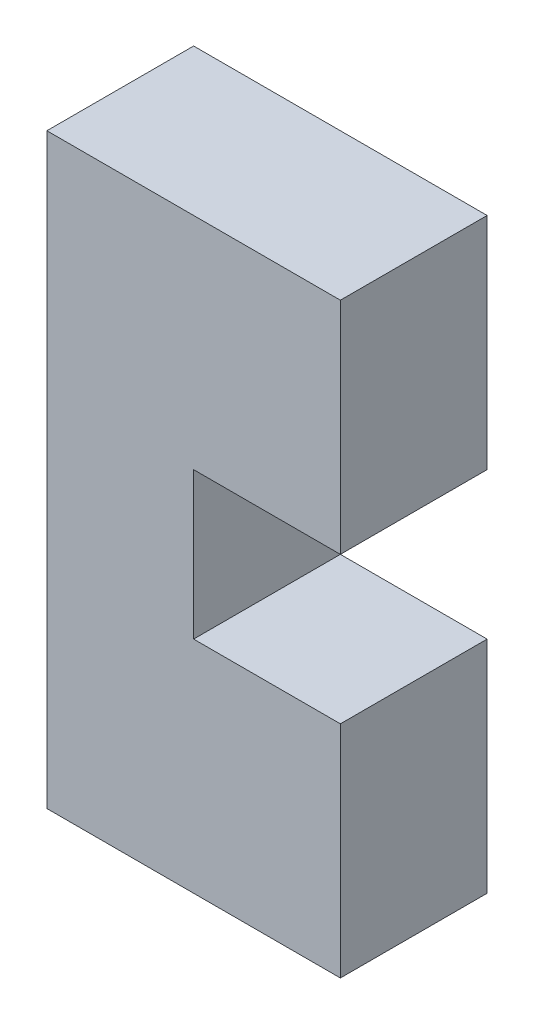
ISO-10303-21;
HEADER;
FILE_DESCRIPTION(('STEP AP214'),'2;1');
FILE_NAME('part.step','',(''),(''),'','','');
FILE_SCHEMA(('AUTOMOTIVE_DESIGN { 1 0 10303 214 1 1 1 1 }'));
ENDSEC;
DATA;
#1=APPLICATION_CONTEXT('core data for automotive mechanical design processes');
#2=APPLICATION_PROTOCOL_DEFINITION('international standard','automotive_design',2000,#1);
#3=PRODUCT_CONTEXT('',#1,'mechanical');
#4=PRODUCT('Part','Part','',(#3));
#5=PRODUCT_RELATED_PRODUCT_CATEGORY('part','',(#4));
#6=PRODUCT_DEFINITION_FORMATION('','',#4);
#7=PRODUCT_DEFINITION_CONTEXT('part definition',#1,'design');
#8=PRODUCT_DEFINITION('design','',#6,#7);
#9=PRODUCT_DEFINITION_SHAPE('','',#8);
#10=(LENGTH_UNIT() NAMED_UNIT(*) SI_UNIT(.MILLI.,.METRE.));
#11=(NAMED_UNIT(*) PLANE_ANGLE_UNIT() SI_UNIT($,.RADIAN.));
#12=(NAMED_UNIT(*) SI_UNIT($,.STERADIAN.) SOLID_ANGLE_UNIT());
#13=UNCERTAINTY_MEASURE_WITH_UNIT(LENGTH_MEASURE(1.E-05),#10,'distance_accuracy_value','');
#14=(GEOMETRIC_REPRESENTATION_CONTEXT(3) GLOBAL_UNCERTAINTY_ASSIGNED_CONTEXT((#13)) GLOBAL_UNIT_ASSIGNED_CONTEXT((#10,
#11,#12)) REPRESENTATION_CONTEXT('',''));
#15=CARTESIAN_POINT('',(0.,0.,0.));
#16=DIRECTION('',(0.,0.,1.));
#17=DIRECTION('',(1.,0.,0.));
#18=AXIS2_PLACEMENT_3D('',#15,#16,#17);
#19=CARTESIAN_POINT('',(-5.,-10.,5.));
#20=DIRECTION('',(1.,0.,0.));
#21=DIRECTION('',(0.,0.,-1.));
#22=AXIS2_PLACEMENT_3D('',#19,#20,#21);
#23=PLANE('',#22);
#24=DIRECTION('',(0.,-1.,0.));
#25=VECTOR('',#24,1.);
#26=CARTESIAN_POINT('',(-5.,-10.,0.));
#27=LINE('',#26,#25);
#28=CARTESIAN_POINT('',(-5.,10.,0.));
#29=VERTEX_POINT('',#28);
#30=CARTESIAN_POINT('',(-5.,-10.,0.));
#31=VERTEX_POINT('',#30);
#32=EDGE_CURVE('E129',#29,#31,#27,.T.);
#33=ORIENTED_EDGE('',*,*,#32,.T.);
#34=DIRECTION('',(0.,0.,-1.));
#35=VECTOR('',#34,1.);
#36=CARTESIAN_POINT('',(-5.,-10.,5.));
#37=LINE('',#36,#35);
#38=CARTESIAN_POINT('',(-5.,-10.,5.));
#39=VERTEX_POINT('',#38);
#40=EDGE_CURVE('E11',#39,#31,#37,.T.);
#41=ORIENTED_EDGE('',*,*,#40,.F.);
#42=DIRECTION('',(0.,-1.,0.));
#43=VECTOR('',#42,1.);
#44=CARTESIAN_POINT('',(-5.,-10.,5.));
#45=LINE('',#44,#43);
#46=CARTESIAN_POINT('',(-5.,10.,5.));
#47=VERTEX_POINT('',#46);
#48=EDGE_CURVE('E143',#47,#39,#45,.T.);
#49=ORIENTED_EDGE('',*,*,#48,.F.);
#50=DIRECTION('',(0.,0.,-1.));
#51=VECTOR('',#50,1.);
#52=CARTESIAN_POINT('',(-5.,10.,5.));
#53=LINE('',#52,#51);
#54=EDGE_CURVE('E125',#47,#29,#53,.T.);
#55=ORIENTED_EDGE('',*,*,#54,.T.);
#56=EDGE_LOOP('',(#33,#41,#49,#55));
#57=FACE_BOUND('',#56,.T.);
#58=ADVANCED_FACE('F33',(#57),#23,.F.);
#59=CARTESIAN_POINT('',(5.,-10.,5.));
#60=DIRECTION('',(0.,1.,0.));
#61=DIRECTION('',(-1.,0.,0.));
#62=AXIS2_PLACEMENT_3D('',#59,#60,#61);
#63=PLANE('',#62);
#64=DIRECTION('',(1.,0.,0.));
#65=VECTOR('',#64,1.);
#66=CARTESIAN_POINT('',(5.,-10.,0.));
#67=LINE('',#66,#65);
#68=CARTESIAN_POINT('',(5.,-10.,0.));
#69=VERTEX_POINT('',#68);
#70=EDGE_CURVE('E132',#31,#69,#67,.T.);
#71=ORIENTED_EDGE('',*,*,#70,.T.);
#72=DIRECTION('',(0.,0.,-1.));
#73=VECTOR('',#72,1.);
#74=CARTESIAN_POINT('',(5.,-10.,5.));
#75=LINE('',#74,#73);
#76=CARTESIAN_POINT('',(5.,-10.,5.));
#77=VERTEX_POINT('',#76);
#78=EDGE_CURVE('E41',#77,#69,#75,.T.);
#79=ORIENTED_EDGE('',*,*,#78,.F.);
#80=DIRECTION('',(1.,0.,0.));
#81=VECTOR('',#80,1.);
#82=CARTESIAN_POINT('',(5.,-10.,5.));
#83=LINE('',#82,#81);
#84=EDGE_CURVE('E92',#39,#77,#83,.T.);
#85=ORIENTED_EDGE('',*,*,#84,.F.);
#86=ORIENTED_EDGE('',*,*,#40,.T.);
#87=EDGE_LOOP('',(#71,#79,#85,#86));
#88=FACE_BOUND('',#87,.T.);
#89=ADVANCED_FACE('F178',(#88),#63,.F.);
#90=CARTESIAN_POINT('',(5.,-2.5,5.));
#91=DIRECTION('',(-1.,0.,0.));
#92=DIRECTION('',(0.,-1.,0.));
#93=AXIS2_PLACEMENT_3D('',#90,#91,#92);
#94=PLANE('',#93);
#95=DIRECTION('',(0.,1.,0.));
#96=VECTOR('',#95,1.);
#97=CARTESIAN_POINT('',(5.,-2.5,0.));
#98=LINE('',#97,#96);
#99=CARTESIAN_POINT('',(5.,-2.5,0.));
#100=VERTEX_POINT('',#99);
#101=EDGE_CURVE('E134',#69,#100,#98,.T.);
#102=ORIENTED_EDGE('',*,*,#101,.T.);
#103=DIRECTION('',(0.,0.,-1.));
#104=VECTOR('',#103,1.);
#105=CARTESIAN_POINT('',(5.,-2.5,5.));
#106=LINE('',#105,#104);
#107=CARTESIAN_POINT('',(5.,-2.5,5.));
#108=VERTEX_POINT('',#107);
#109=EDGE_CURVE('E150',#108,#100,#106,.T.);
#110=ORIENTED_EDGE('',*,*,#109,.F.);
#111=DIRECTION('',(0.,1.,0.));
#112=VECTOR('',#111,1.);
#113=CARTESIAN_POINT('',(5.,-2.5,5.));
#114=LINE('',#113,#112);
#115=EDGE_CURVE('E158',#77,#108,#114,.T.);
#116=ORIENTED_EDGE('',*,*,#115,.F.);
#117=ORIENTED_EDGE('',*,*,#78,.T.);
#118=EDGE_LOOP('',(#102,#110,#116,#117));
#119=FACE_BOUND('',#118,.T.);
#120=ADVANCED_FACE('F156',(#119),#94,.F.);
#121=CARTESIAN_POINT('',(0.,-2.5,5.));
#122=DIRECTION('',(0.,-1.,0.));
#123=DIRECTION('',(0.,0.,-1.));
#124=AXIS2_PLACEMENT_3D('',#121,#122,#123);
#125=PLANE('',#124);
#126=DIRECTION('',(-1.,0.,0.));
#127=VECTOR('',#126,1.);
#128=CARTESIAN_POINT('',(0.,-2.5,0.));
#129=LINE('',#128,#127);
#130=CARTESIAN_POINT('',(0.,-2.5,0.));
#131=VERTEX_POINT('',#130);
#132=EDGE_CURVE('E136',#100,#131,#129,.T.);
#133=ORIENTED_EDGE('',*,*,#132,.T.);
#134=DIRECTION('',(0.,0.,-1.));
#135=VECTOR('',#134,1.);
#136=CARTESIAN_POINT('',(0.,-2.5,5.));
#137=LINE('',#136,#135);
#138=CARTESIAN_POINT('',(0.,-2.5,5.));
#139=VERTEX_POINT('',#138);
#140=EDGE_CURVE('E147',#139,#131,#137,.T.);
#141=ORIENTED_EDGE('',*,*,#140,.F.);
#142=DIRECTION('',(-1.,0.,0.));
#143=VECTOR('',#142,1.);
#144=CARTESIAN_POINT('',(0.,-2.5,5.));
#145=LINE('',#144,#143);
#146=EDGE_CURVE('E170',#108,#139,#145,.T.);
#147=ORIENTED_EDGE('',*,*,#146,.F.);
#148=ORIENTED_EDGE('',*,*,#109,.T.);
#149=EDGE_LOOP('',(#133,#141,#147,#148));
#150=FACE_BOUND('',#149,.T.);
#151=ADVANCED_FACE('F166',(#150),#125,.F.);
#152=CARTESIAN_POINT('',(0.,2.5,5.));
#153=DIRECTION('',(-1.,0.,0.));
#154=DIRECTION('',(0.,-1.,0.));
#155=AXIS2_PLACEMENT_3D('',#152,#153,#154);
#156=PLANE('',#155);
#157=DIRECTION('',(0.,1.,0.));
#158=VECTOR('',#157,1.);
#159=CARTESIAN_POINT('',(0.,2.5,0.));
#160=LINE('',#159,#158);
#161=CARTESIAN_POINT('',(0.,2.5,0.));
#162=VERTEX_POINT('',#161);
#163=EDGE_CURVE('E138',#131,#162,#160,.T.);
#164=ORIENTED_EDGE('',*,*,#163,.T.);
#165=DIRECTION('',(0.,0.,-1.));
#166=VECTOR('',#165,1.);
#167=CARTESIAN_POINT('',(0.,2.5,5.));
#168=LINE('',#167,#166);
#169=CARTESIAN_POINT('',(0.,2.5,5.));
#170=VERTEX_POINT('',#169);
#171=EDGE_CURVE('E120',#170,#162,#168,.T.);
#172=ORIENTED_EDGE('',*,*,#171,.F.);
#173=DIRECTION('',(0.,1.,0.));
#174=VECTOR('',#173,1.);
#175=CARTESIAN_POINT('',(0.,2.5,5.));
#176=LINE('',#175,#174);
#177=EDGE_CURVE('E111',#139,#170,#176,.T.);
#178=ORIENTED_EDGE('',*,*,#177,.F.);
#179=ORIENTED_EDGE('',*,*,#140,.T.);
#180=EDGE_LOOP('',(#164,#172,#178,#179));
#181=FACE_BOUND('',#180,.T.);
#182=ADVANCED_FACE('F169',(#181),#156,.F.);
#183=CARTESIAN_POINT('',(5.,2.5,5.));
#184=DIRECTION('',(0.,1.,0.));
#185=DIRECTION('',(-1.,0.,0.));
#186=AXIS2_PLACEMENT_3D('',#183,#184,#185);
#187=PLANE('',#186);
#188=DIRECTION('',(1.,0.,0.));
#189=VECTOR('',#188,1.);
#190=CARTESIAN_POINT('',(5.,2.5,0.));
#191=LINE('',#190,#189);
#192=CARTESIAN_POINT('',(5.,2.5,0.));
#193=VERTEX_POINT('',#192);
#194=EDGE_CURVE('E119',#162,#193,#191,.T.);
#195=ORIENTED_EDGE('',*,*,#194,.T.);
#196=DIRECTION('',(0.,0.,-1.));
#197=VECTOR('',#196,1.);
#198=CARTESIAN_POINT('',(5.,2.5,5.));
#199=LINE('',#198,#197);
#200=CARTESIAN_POINT('',(5.,2.5,5.));
#201=VERTEX_POINT('',#200);
#202=EDGE_CURVE('E116',#201,#193,#199,.T.);
#203=ORIENTED_EDGE('',*,*,#202,.F.);
#204=DIRECTION('',(1.,0.,0.));
#205=VECTOR('',#204,1.);
#206=CARTESIAN_POINT('',(5.,2.5,5.));
#207=LINE('',#206,#205);
#208=EDGE_CURVE('E105',#170,#201,#207,.T.);
#209=ORIENTED_EDGE('',*,*,#208,.F.);
#210=ORIENTED_EDGE('',*,*,#171,.T.);
#211=EDGE_LOOP('',(#195,#203,#209,#210));
#212=FACE_BOUND('',#211,.T.);
#213=ADVANCED_FACE('F117',(#212),#187,.F.);
#214=CARTESIAN_POINT('',(5.,10.,5.));
#215=DIRECTION('',(-1.,0.,0.));
#216=DIRECTION('',(0.,-1.,0.));
#217=AXIS2_PLACEMENT_3D('',#214,#215,#216);
#218=PLANE('',#217);
#219=DIRECTION('',(0.,1.,0.));
#220=VECTOR('',#219,1.);
#221=CARTESIAN_POINT('',(5.,10.,0.));
#222=LINE('',#221,#220);
#223=CARTESIAN_POINT('',(5.,10.,0.));
#224=VERTEX_POINT('',#223);
#225=EDGE_CURVE('E78',#193,#224,#222,.T.);
#226=ORIENTED_EDGE('',*,*,#225,.T.);
#227=DIRECTION('',(0.,0.,-1.));
#228=VECTOR('',#227,1.);
#229=CARTESIAN_POINT('',(5.,10.,5.));
#230=LINE('',#229,#228);
#231=CARTESIAN_POINT('',(5.,10.,5.));
#232=VERTEX_POINT('',#231);
#233=EDGE_CURVE('E121',#232,#224,#230,.T.);
#234=ORIENTED_EDGE('',*,*,#233,.F.);
#235=DIRECTION('',(0.,1.,0.));
#236=VECTOR('',#235,1.);
#237=CARTESIAN_POINT('',(5.,10.,5.));
#238=LINE('',#237,#236);
#239=EDGE_CURVE('E109',#201,#232,#238,.T.);
#240=ORIENTED_EDGE('',*,*,#239,.F.);
#241=ORIENTED_EDGE('',*,*,#202,.T.);
#242=EDGE_LOOP('',(#226,#234,#240,#241));
#243=FACE_BOUND('',#242,.T.);
#244=ADVANCED_FACE('F123',(#243),#218,.F.);
#245=CARTESIAN_POINT('',(-5.,10.,5.));
#246=DIRECTION('',(0.,-1.,0.));
#247=DIRECTION('',(0.,0.,-1.));
#248=AXIS2_PLACEMENT_3D('',#245,#246,#247);
#249=PLANE('',#248);
#250=DIRECTION('',(-1.,0.,0.));
#251=VECTOR('',#250,1.);
#252=CARTESIAN_POINT('',(-5.,10.,0.));
#253=LINE('',#252,#251);
#254=EDGE_CURVE('E84',#224,#29,#253,.T.);
#255=ORIENTED_EDGE('',*,*,#254,.T.);
#256=ORIENTED_EDGE('',*,*,#54,.F.);
#257=DIRECTION('',(-1.,0.,0.));
#258=VECTOR('',#257,1.);
#259=CARTESIAN_POINT('',(-5.,10.,5.));
#260=LINE('',#259,#258);
#261=EDGE_CURVE('E49',#232,#47,#260,.T.);
#262=ORIENTED_EDGE('',*,*,#261,.F.);
#263=ORIENTED_EDGE('',*,*,#233,.T.);
#264=EDGE_LOOP('',(#255,#256,#262,#263));
#265=FACE_BOUND('',#264,.T.);
#266=ADVANCED_FACE('F194',(#265),#249,.F.);
#267=CARTESIAN_POINT('',(0.,0.,5.));
#268=DIRECTION('',(0.,0.,-1.));
#269=DIRECTION('',(-1.,0.,0.));
#270=AXIS2_PLACEMENT_3D('',#267,#268,#269);
#271=PLANE('',#270);
#272=ORIENTED_EDGE('',*,*,#48,.T.);
#273=ORIENTED_EDGE('',*,*,#84,.T.);
#274=ORIENTED_EDGE('',*,*,#115,.T.);
#275=ORIENTED_EDGE('',*,*,#146,.T.);
#276=ORIENTED_EDGE('',*,*,#177,.T.);
#277=ORIENTED_EDGE('',*,*,#208,.T.);
#278=ORIENTED_EDGE('',*,*,#239,.T.);
#279=ORIENTED_EDGE('',*,*,#261,.T.);
#280=EDGE_LOOP('',(#272,#273,#274,#275,#276,#277,#278,#279));
#281=FACE_BOUND('',#280,.T.);
#282=ADVANCED_FACE('F107',(#281),#271,.F.);
#283=CARTESIAN_POINT('',(0.,0.,0.));
#284=DIRECTION('',(0.,0.,-1.));
#285=DIRECTION('',(-1.,0.,0.));
#286=AXIS2_PLACEMENT_3D('',#283,#284,#285);
#287=PLANE('',#286);
#288=ORIENTED_EDGE('',*,*,#32,.F.);
#289=ORIENTED_EDGE('',*,*,#254,.F.);
#290=ORIENTED_EDGE('',*,*,#225,.F.);
#291=ORIENTED_EDGE('',*,*,#194,.F.);
#292=ORIENTED_EDGE('',*,*,#163,.F.);
#293=ORIENTED_EDGE('',*,*,#132,.F.);
#294=ORIENTED_EDGE('',*,*,#101,.F.);
#295=ORIENTED_EDGE('',*,*,#70,.F.);
#296=EDGE_LOOP('',(#288,#289,#290,#291,#292,#293,#294,#295));
#297=FACE_BOUND('',#296,.T.);
#298=ADVANCED_FACE('F162',(#297),#287,.T.);
#299=CLOSED_SHELL('',(#58,#89,#120,#151,#182,#213,#244,#266,#282,#298));
#300=MANIFOLD_SOLID_BREP('B2',#299);
#301=ADVANCED_BREP_SHAPE_REPRESENTATION('',(#18,#300),#14);
#302=SHAPE_DEFINITION_REPRESENTATION(#9,#301);
ENDSEC;
END-ISO-10303-21;
